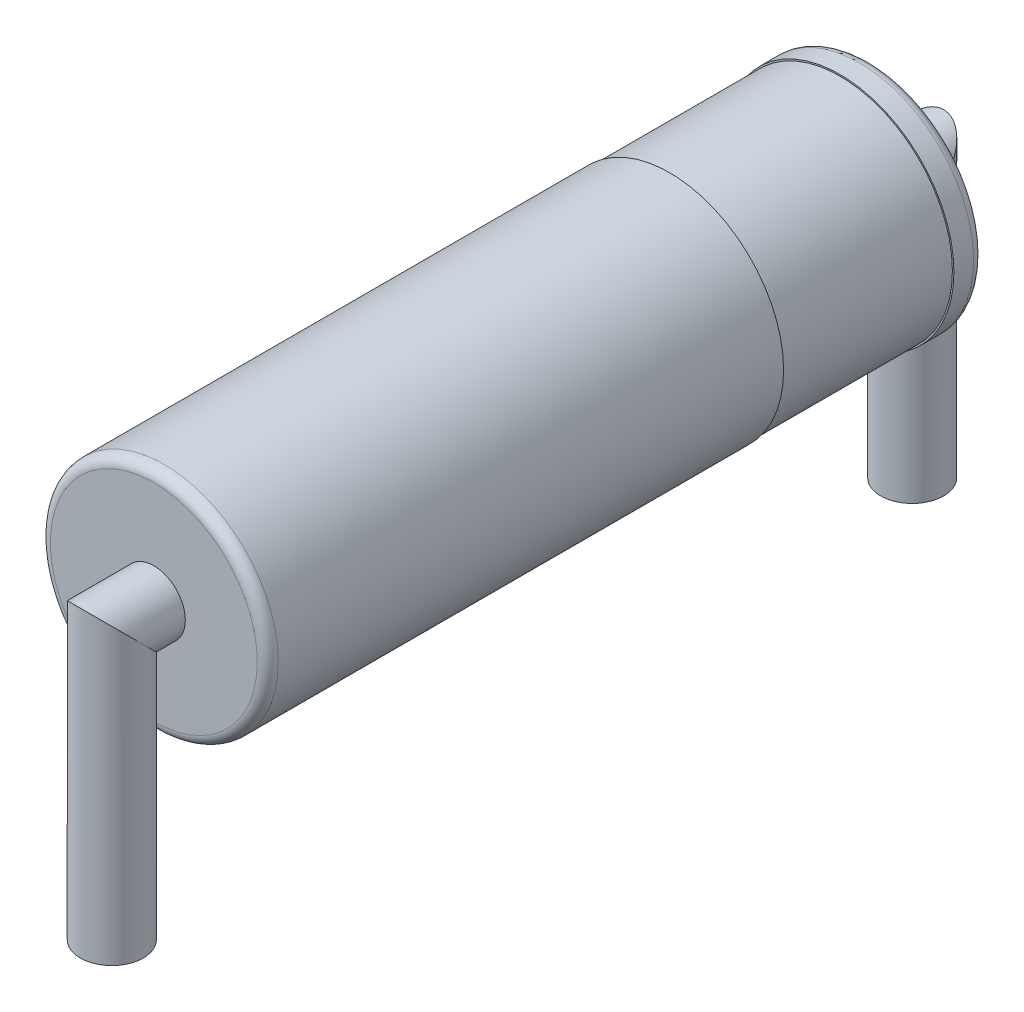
from build123d import *

# Parameters (mm, degrees)
ESQUISSE1_R      = 1.085
EXTRUSION1_DEPTH = 3.41
CONG_1_R         = 0.1
ESQUISSE2_R      = 0.3
ESQUISSE4_W      = 1.621102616
ESQUISSE4_H      = 0.082628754


with BuildPart() as part:
    # Esquisse1 → Extrusion1 (new, symmetric)
    with BuildSketch(Plane.XY):
        Circle(ESQUISSE1_R)
    extrude(amount=EXTRUSION1_DEPTH, both=True)

    # Cong_1
    cong_1_edges = [part.edges().sort_by_distance(p)[0] for p in [
        (-1.085, 0, -3.41),
        (-1.085, 0, 3.41),
    ]]
    fillet(cong_1_edges, radius=CONG_1_R)

    # Balayage1: sweep along a path in Esquisse3
    with BuildLine(Plane(origin=(0, 0, 0), x_dir=(0, 0, -1), z_dir=(1, 0, 0))) as balayage1_path:
        Line((3.41, 0), (3.81, 0))
        Line((3.81, 0), (3.81, -2.585))
    # Esquisse2 → Balayage1 (sweep)
    with BuildSketch(Plane(origin=(0, 0, -3.41), x_dir=(-1, 0, 0), z_dir=(0, 0, -1))):
        Circle(ESQUISSE2_R)
    balayage1 = sweep(path=balayage1_path.line, transition=Transition.RIGHT)

    # Sym_trie1: Balayage1 across plane
    add(balayage1.mirror(Plane.XY))

    # Esquisse4 → Enl_vement de mati_re-R_volution1 (revolve, cut)
    with BuildSketch(Plane(origin=(0, 0, 0), x_dir=(0, 0, -1), z_dir=(1, 0, 0)), mode=Mode.PRIVATE) as enl_vement_de_mati_re_r_volution1_sk:
        with Locations((2.311378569, 1.11223235)):
            Rectangle(ESQUISSE4_W, ESQUISSE4_H)
    revolve(enl_vement_de_mati_re_r_volution1_sk.sketch.rotate(Axis((0, 0, 0), (0, 0, -1)), 90), axis=Axis((0, 0, 0), (0, 0, -1)), mode=Mode.SUBTRACT)


solid = part.part
